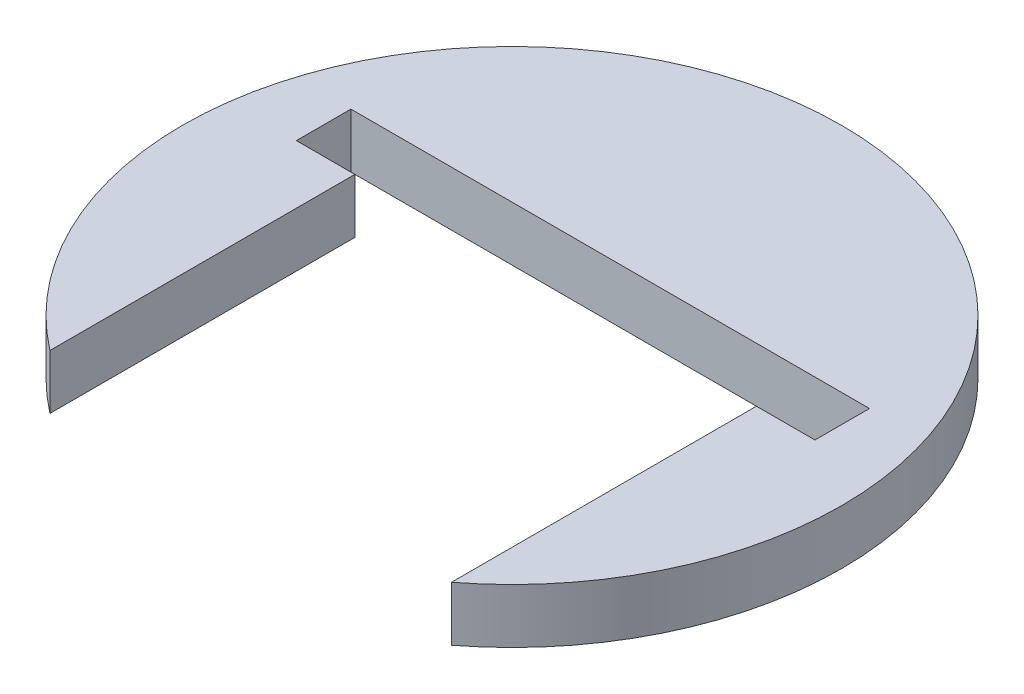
ISO-10303-21;
HEADER;
FILE_DESCRIPTION(('STEP AP214'),'2;1');
FILE_NAME('part.step','',(''),(''),'','','');
FILE_SCHEMA(('AUTOMOTIVE_DESIGN { 1 0 10303 214 1 1 1 1 }'));
ENDSEC;
DATA;
#1=APPLICATION_CONTEXT('core data for automotive mechanical design processes');
#2=APPLICATION_PROTOCOL_DEFINITION('international standard','automotive_design',2000,#1);
#3=PRODUCT_CONTEXT('',#1,'mechanical');
#4=PRODUCT('Part','Part','',(#3));
#5=PRODUCT_RELATED_PRODUCT_CATEGORY('part','',(#4));
#6=PRODUCT_DEFINITION_FORMATION('','',#4);
#7=PRODUCT_DEFINITION_CONTEXT('part definition',#1,'design');
#8=PRODUCT_DEFINITION('design','',#6,#7);
#9=PRODUCT_DEFINITION_SHAPE('','',#8);
#10=(LENGTH_UNIT() NAMED_UNIT(*) SI_UNIT(.MILLI.,.METRE.));
#11=(NAMED_UNIT(*) PLANE_ANGLE_UNIT() SI_UNIT($,.RADIAN.));
#12=(NAMED_UNIT(*) SI_UNIT($,.STERADIAN.) SOLID_ANGLE_UNIT());
#13=UNCERTAINTY_MEASURE_WITH_UNIT(LENGTH_MEASURE(1.E-05),#10,'distance_accuracy_value','');
#14=(GEOMETRIC_REPRESENTATION_CONTEXT(3) GLOBAL_UNCERTAINTY_ASSIGNED_CONTEXT((#13)) GLOBAL_UNIT_ASSIGNED_CONTEXT((#10,
#11,#12)) REPRESENTATION_CONTEXT('',''));
#15=CARTESIAN_POINT('',(0.,0.,0.));
#16=DIRECTION('',(0.,0.,1.));
#17=DIRECTION('',(1.,0.,0.));
#18=AXIS2_PLACEMENT_3D('',#15,#16,#17);
#19=CARTESIAN_POINT('',(-15.0899035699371,0.,-2.54));
#20=DIRECTION('',(0.,0.,1.));
#21=DIRECTION('',(1.,0.,0.));
#22=AXIS2_PLACEMENT_3D('',#19,#20,#21);
#23=PLANE('',#22);
#24=DIRECTION('',(1.,0.,0.));
#25=VECTOR('',#24,1.);
#26=CARTESIAN_POINT('',(-15.0899035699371,0.,-2.54));
#27=LINE('',#26,#25);
#28=CARTESIAN_POINT('',(11.684,0.,-2.54));
#29=VERTEX_POINT('',#28);
#30=CARTESIAN_POINT('',(15.0899035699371,0.,-2.54));
#31=VERTEX_POINT('',#30);
#32=EDGE_CURVE('E112',#29,#31,#27,.T.);
#33=ORIENTED_EDGE('',*,*,#32,.F.);
#34=DIRECTION('',(0.,1.,0.));
#35=VECTOR('',#34,1.);
#36=CARTESIAN_POINT('',(11.684,0.,-2.54));
#37=LINE('',#36,#35);
#38=CARTESIAN_POINT('',(11.684,3.175,-2.54));
#39=VERTEX_POINT('',#38);
#40=EDGE_CURVE('E98',#29,#39,#37,.T.);
#41=ORIENTED_EDGE('',*,*,#40,.T.);
#42=DIRECTION('',(1.,0.,0.));
#43=VECTOR('',#42,1.);
#44=CARTESIAN_POINT('',(-15.0899035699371,3.175,-2.54));
#45=LINE('',#44,#43);
#46=CARTESIAN_POINT('',(15.0899035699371,3.175,-2.54));
#47=VERTEX_POINT('',#46);
#48=EDGE_CURVE('E139',#39,#47,#45,.T.);
#49=ORIENTED_EDGE('',*,*,#48,.T.);
#50=DIRECTION('',(0.,1.,0.));
#51=VECTOR('',#50,1.);
#52=CARTESIAN_POINT('',(15.0899035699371,0.,-2.54));
#53=LINE('',#52,#51);
#54=EDGE_CURVE('E118',#31,#47,#53,.T.);
#55=ORIENTED_EDGE('',*,*,#54,.F.);
#56=EDGE_LOOP('',(#33,#41,#49,#55));
#57=FACE_BOUND('',#56,.T.);
#58=ADVANCED_FACE('F36',(#57),#23,.F.);
#59=CARTESIAN_POINT('',(0.,3.175,0.));
#60=DIRECTION('',(0.,-1.,0.));
#61=DIRECTION('',(0.,0.,-1.));
#62=AXIS2_PLACEMENT_3D('',#59,#60,#61);
#63=CYLINDRICAL_SURFACE('',#62,19.177);
#64=CARTESIAN_POINT('',(0.,3.175,0.));
#65=DIRECTION('',(0.,1.,0.));
#66=DIRECTION('',(0.,0.,1.));
#67=AXIS2_PLACEMENT_3D('',#64,#65,#66);
#68=CIRCLE('',#67,19.177);
#69=CARTESIAN_POINT('',(11.684,3.175,15.206625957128));
#70=VERTEX_POINT('',#69);
#71=CARTESIAN_POINT('',(-11.684,3.175,15.206625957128));
#72=VERTEX_POINT('',#71);
#73=EDGE_CURVE('E11',#70,#72,#68,.T.);
#74=ORIENTED_EDGE('',*,*,#73,.F.);
#75=DIRECTION('',(0.,-1.,0.));
#76=VECTOR('',#75,1.);
#77=CARTESIAN_POINT('',(11.684,3.175,15.206625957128));
#78=LINE('',#77,#76);
#79=CARTESIAN_POINT('',(11.684,0.,15.206625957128));
#80=VERTEX_POINT('',#79);
#81=EDGE_CURVE('E133',#70,#80,#78,.T.);
#82=ORIENTED_EDGE('',*,*,#81,.T.);
#83=CARTESIAN_POINT('',(0.,0.,0.));
#84=DIRECTION('',(0.,1.,0.));
#85=DIRECTION('',(0.,0.,1.));
#86=AXIS2_PLACEMENT_3D('',#83,#84,#85);
#87=CIRCLE('',#86,19.177);
#88=CARTESIAN_POINT('',(-11.684,0.,15.206625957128));
#89=VERTEX_POINT('',#88);
#90=EDGE_CURVE('E40',#80,#89,#87,.T.);
#91=ORIENTED_EDGE('',*,*,#90,.T.);
#92=DIRECTION('',(0.,-1.,0.));
#93=VECTOR('',#92,1.);
#94=CARTESIAN_POINT('',(-11.684,3.175,15.206625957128));
#95=LINE('',#94,#93);
#96=EDGE_CURVE('E169',#89,#72,#95,.F.);
#97=ORIENTED_EDGE('',*,*,#96,.T.);
#98=EDGE_LOOP('',(#74,#82,#91,#97));
#99=FACE_BOUND('',#98,.T.);
#100=ADVANCED_FACE('F38',(#99),#63,.T.);
#101=CARTESIAN_POINT('',(0.,3.175,0.));
#102=DIRECTION('',(0.,1.,0.));
#103=DIRECTION('',(0.,0.,1.));
#104=AXIS2_PLACEMENT_3D('',#101,#102,#103);
#105=PLANE('',#104);
#106=DIRECTION('',(0.,0.,-1.));
#107=VECTOR('',#106,1.);
#108=CARTESIAN_POINT('',(11.684,3.175,22.86));
#109=LINE('',#108,#107);
#110=EDGE_CURVE('E59',#70,#39,#109,.T.);
#111=ORIENTED_EDGE('',*,*,#110,.F.);
#112=ORIENTED_EDGE('',*,*,#73,.T.);
#113=DIRECTION('',(0.,0.,1.));
#114=VECTOR('',#113,1.);
#115=CARTESIAN_POINT('',(-11.684,3.175,22.86));
#116=LINE('',#115,#114);
#117=CARTESIAN_POINT('',(-11.684,3.175,-2.54));
#118=VERTEX_POINT('',#117);
#119=EDGE_CURVE('E115',#118,#72,#116,.T.);
#120=ORIENTED_EDGE('',*,*,#119,.F.);
#121=CARTESIAN_POINT('',(-15.0899035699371,3.175,-2.54));
#122=VERTEX_POINT('',#121);
#123=EDGE_CURVE('E140',#122,#118,#45,.T.);
#124=ORIENTED_EDGE('',*,*,#123,.F.);
#125=DIRECTION('',(0.,0.,1.));
#126=VECTOR('',#125,1.);
#127=CARTESIAN_POINT('',(-15.0899035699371,3.175,-2.54));
#128=LINE('',#127,#126);
#129=CARTESIAN_POINT('',(-15.0899035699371,3.175,-5.715));
#130=VERTEX_POINT('',#129);
#131=EDGE_CURVE('E136',#130,#122,#128,.T.);
#132=ORIENTED_EDGE('',*,*,#131,.F.);
#133=DIRECTION('',(-1.,0.,0.));
#134=VECTOR('',#133,1.);
#135=CARTESIAN_POINT('',(-15.0899035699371,3.175,-5.715));
#136=LINE('',#135,#134);
#137=CARTESIAN_POINT('',(15.0899035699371,3.175,-5.715));
#138=VERTEX_POINT('',#137);
#139=EDGE_CURVE('E132',#138,#130,#136,.T.);
#140=ORIENTED_EDGE('',*,*,#139,.F.);
#141=DIRECTION('',(0.,0.,-1.));
#142=VECTOR('',#141,1.);
#143=CARTESIAN_POINT('',(15.0899035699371,3.175,-2.54));
#144=LINE('',#143,#142);
#145=EDGE_CURVE('E130',#47,#138,#144,.T.);
#146=ORIENTED_EDGE('',*,*,#145,.F.);
#147=ORIENTED_EDGE('',*,*,#48,.F.);
#148=EDGE_LOOP('',(#111,#112,#120,#124,#132,#140,#146,#147));
#149=FACE_BOUND('',#148,.T.);
#150=ADVANCED_FACE('F160',(#149),#105,.T.);
#151=CARTESIAN_POINT('',(0.,0.,0.));
#152=DIRECTION('',(0.,1.,0.));
#153=DIRECTION('',(0.,0.,1.));
#154=AXIS2_PLACEMENT_3D('',#151,#152,#153);
#155=PLANE('',#154);
#156=ORIENTED_EDGE('',*,*,#90,.F.);
#157=DIRECTION('',(0.,0.,-1.));
#158=VECTOR('',#157,1.);
#159=CARTESIAN_POINT('',(11.684,0.,22.86));
#160=LINE('',#159,#158);
#161=EDGE_CURVE('E101',#80,#29,#160,.T.);
#162=ORIENTED_EDGE('',*,*,#161,.T.);
#163=ORIENTED_EDGE('',*,*,#32,.T.);
#164=DIRECTION('',(0.,0.,-1.));
#165=VECTOR('',#164,1.);
#166=CARTESIAN_POINT('',(15.0899035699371,0.,-2.54));
#167=LINE('',#166,#165);
#168=CARTESIAN_POINT('',(15.0899035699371,0.,-5.715));
#169=VERTEX_POINT('',#168);
#170=EDGE_CURVE('E143',#31,#169,#167,.T.);
#171=ORIENTED_EDGE('',*,*,#170,.T.);
#172=DIRECTION('',(-1.,0.,0.));
#173=VECTOR('',#172,1.);
#174=CARTESIAN_POINT('',(-15.0899035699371,0.,-5.715));
#175=LINE('',#174,#173);
#176=CARTESIAN_POINT('',(-15.0899035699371,0.,-5.715));
#177=VERTEX_POINT('',#176);
#178=EDGE_CURVE('E126',#169,#177,#175,.T.);
#179=ORIENTED_EDGE('',*,*,#178,.T.);
#180=DIRECTION('',(0.,0.,1.));
#181=VECTOR('',#180,1.);
#182=CARTESIAN_POINT('',(-15.0899035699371,0.,-2.54));
#183=LINE('',#182,#181);
#184=CARTESIAN_POINT('',(-15.0899035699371,0.,-2.54));
#185=VERTEX_POINT('',#184);
#186=EDGE_CURVE('E121',#177,#185,#183,.T.);
#187=ORIENTED_EDGE('',*,*,#186,.T.);
#188=CARTESIAN_POINT('',(-11.684,0.,-2.54));
#189=VERTEX_POINT('',#188);
#190=EDGE_CURVE('E120',#185,#189,#27,.T.);
#191=ORIENTED_EDGE('',*,*,#190,.T.);
#192=DIRECTION('',(0.,0.,1.));
#193=VECTOR('',#192,1.);
#194=CARTESIAN_POINT('',(-11.684,0.,22.86));
#195=LINE('',#194,#193);
#196=EDGE_CURVE('E51',#189,#89,#195,.T.);
#197=ORIENTED_EDGE('',*,*,#196,.T.);
#198=EDGE_LOOP('',(#156,#162,#163,#171,#179,#187,#191,#197));
#199=FACE_BOUND('',#198,.T.);
#200=ADVANCED_FACE('F110',(#199),#155,.F.);
#201=CARTESIAN_POINT('',(15.0899035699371,0.,-2.54));
#202=DIRECTION('',(1.,0.,0.));
#203=DIRECTION('',(0.,0.,-1.));
#204=AXIS2_PLACEMENT_3D('',#201,#202,#203);
#205=PLANE('',#204);
#206=ORIENTED_EDGE('',*,*,#145,.T.);
#207=DIRECTION('',(0.,1.,0.));
#208=VECTOR('',#207,1.);
#209=CARTESIAN_POINT('',(15.0899035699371,0.,-5.715));
#210=LINE('',#209,#208);
#211=EDGE_CURVE('E124',#169,#138,#210,.T.);
#212=ORIENTED_EDGE('',*,*,#211,.F.);
#213=ORIENTED_EDGE('',*,*,#170,.F.);
#214=ORIENTED_EDGE('',*,*,#54,.T.);
#215=EDGE_LOOP('',(#206,#212,#213,#214));
#216=FACE_BOUND('',#215,.T.);
#217=ADVANCED_FACE('F177',(#216),#205,.F.);
#218=ORIENTED_EDGE('',*,*,#123,.T.);
#219=DIRECTION('',(0.,1.,0.));
#220=VECTOR('',#219,1.);
#221=CARTESIAN_POINT('',(-11.684,0.,-2.54));
#222=LINE('',#221,#220);
#223=EDGE_CURVE('E106',#189,#118,#222,.T.);
#224=ORIENTED_EDGE('',*,*,#223,.F.);
#225=ORIENTED_EDGE('',*,*,#190,.F.);
#226=DIRECTION('',(0.,1.,0.));
#227=VECTOR('',#226,1.);
#228=CARTESIAN_POINT('',(-15.0899035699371,0.,-2.54));
#229=LINE('',#228,#227);
#230=EDGE_CURVE('E145',#185,#122,#229,.T.);
#231=ORIENTED_EDGE('',*,*,#230,.T.);
#232=EDGE_LOOP('',(#218,#224,#225,#231));
#233=FACE_BOUND('',#232,.T.);
#234=ADVANCED_FACE('F179',(#233),#23,.F.);
#235=CARTESIAN_POINT('',(-15.0899035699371,0.,-2.54));
#236=DIRECTION('',(-1.,0.,0.));
#237=DIRECTION('',(0.,0.,1.));
#238=AXIS2_PLACEMENT_3D('',#235,#236,#237);
#239=PLANE('',#238);
#240=ORIENTED_EDGE('',*,*,#131,.T.);
#241=ORIENTED_EDGE('',*,*,#230,.F.);
#242=ORIENTED_EDGE('',*,*,#186,.F.);
#243=DIRECTION('',(0.,1.,0.));
#244=VECTOR('',#243,1.);
#245=CARTESIAN_POINT('',(-15.0899035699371,0.,-5.715));
#246=LINE('',#245,#244);
#247=EDGE_CURVE('E147',#177,#130,#246,.T.);
#248=ORIENTED_EDGE('',*,*,#247,.T.);
#249=EDGE_LOOP('',(#240,#241,#242,#248));
#250=FACE_BOUND('',#249,.T.);
#251=ADVANCED_FACE('F164',(#250),#239,.F.);
#252=CARTESIAN_POINT('',(-15.0899035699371,0.,-5.715));
#253=DIRECTION('',(0.,0.,-1.));
#254=DIRECTION('',(-1.,0.,0.));
#255=AXIS2_PLACEMENT_3D('',#252,#253,#254);
#256=PLANE('',#255);
#257=ORIENTED_EDGE('',*,*,#139,.T.);
#258=ORIENTED_EDGE('',*,*,#247,.F.);
#259=ORIENTED_EDGE('',*,*,#178,.F.);
#260=ORIENTED_EDGE('',*,*,#211,.T.);
#261=EDGE_LOOP('',(#257,#258,#259,#260));
#262=FACE_BOUND('',#261,.T.);
#263=ADVANCED_FACE('F153',(#262),#256,.F.);
#264=CARTESIAN_POINT('',(-11.684,0.,22.86));
#265=DIRECTION('',(-1.,0.,0.));
#266=DIRECTION('',(0.,0.,1.));
#267=AXIS2_PLACEMENT_3D('',#264,#265,#266);
#268=PLANE('',#267);
#269=ORIENTED_EDGE('',*,*,#196,.F.);
#270=ORIENTED_EDGE('',*,*,#223,.T.);
#271=ORIENTED_EDGE('',*,*,#119,.T.);
#272=ORIENTED_EDGE('',*,*,#96,.F.);
#273=EDGE_LOOP('',(#269,#270,#271,#272));
#274=FACE_BOUND('',#273,.T.);
#275=ADVANCED_FACE('F198',(#274),#268,.F.);
#276=CARTESIAN_POINT('',(11.684,0.,22.86));
#277=DIRECTION('',(1.,0.,0.));
#278=DIRECTION('',(0.,0.,-1.));
#279=AXIS2_PLACEMENT_3D('',#276,#277,#278);
#280=PLANE('',#279);
#281=ORIENTED_EDGE('',*,*,#110,.T.);
#282=ORIENTED_EDGE('',*,*,#40,.F.);
#283=ORIENTED_EDGE('',*,*,#161,.F.);
#284=ORIENTED_EDGE('',*,*,#81,.F.);
#285=EDGE_LOOP('',(#281,#282,#283,#284));
#286=FACE_BOUND('',#285,.T.);
#287=ADVANCED_FACE('F100',(#286),#280,.F.);
#288=CLOSED_SHELL('',(#58,#100,#150,#200,#217,#234,#251,#263,#275,#287));
#289=MANIFOLD_SOLID_BREP('B2',#288);
#290=ADVANCED_BREP_SHAPE_REPRESENTATION('',(#18,#289),#14);
#291=SHAPE_DEFINITION_REPRESENTATION(#9,#290);
ENDSEC;
END-ISO-10303-21;
